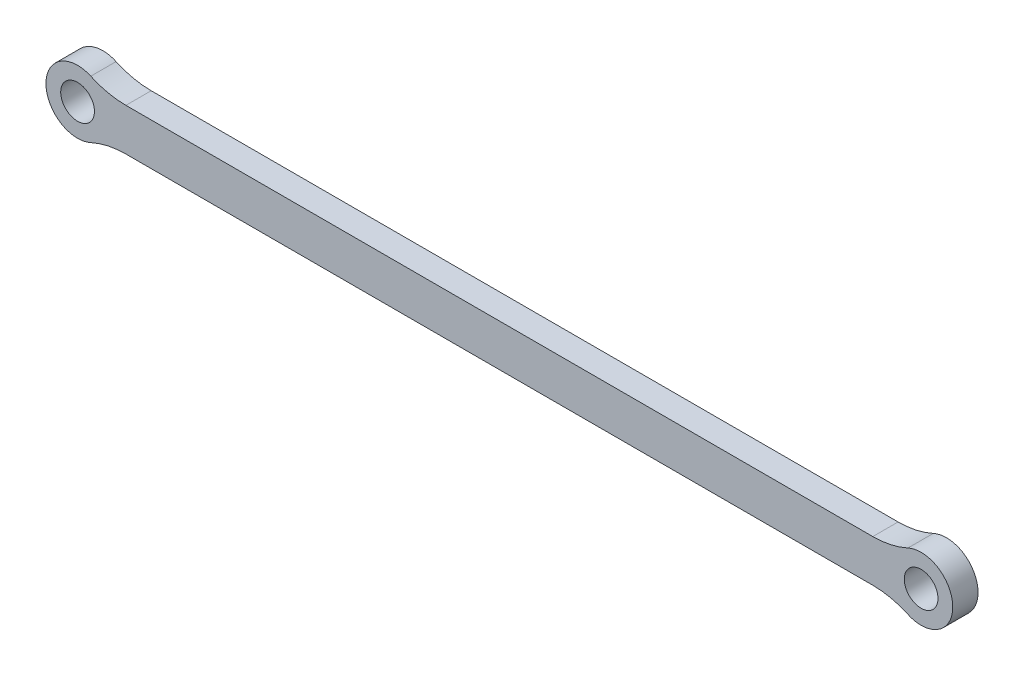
ISO-10303-21;
HEADER;
FILE_DESCRIPTION(('STEP AP214'),'2;1');
FILE_NAME('part.step','',(''),(''),'','','');
FILE_SCHEMA(('AUTOMOTIVE_DESIGN { 1 0 10303 214 1 1 1 1 }'));
ENDSEC;
DATA;
#1=APPLICATION_CONTEXT('core data for automotive mechanical design processes');
#2=APPLICATION_PROTOCOL_DEFINITION('international standard','automotive_design',2000,#1);
#3=PRODUCT_CONTEXT('',#1,'mechanical');
#4=PRODUCT('Part','Part','',(#3));
#5=PRODUCT_RELATED_PRODUCT_CATEGORY('part','',(#4));
#6=PRODUCT_DEFINITION_FORMATION('','',#4);
#7=PRODUCT_DEFINITION_CONTEXT('part definition',#1,'design');
#8=PRODUCT_DEFINITION('design','',#6,#7);
#9=PRODUCT_DEFINITION_SHAPE('','',#8);
#10=(LENGTH_UNIT() NAMED_UNIT(*) SI_UNIT(.MILLI.,.METRE.));
#11=(NAMED_UNIT(*) PLANE_ANGLE_UNIT() SI_UNIT($,.RADIAN.));
#12=(NAMED_UNIT(*) SI_UNIT($,.STERADIAN.) SOLID_ANGLE_UNIT());
#13=UNCERTAINTY_MEASURE_WITH_UNIT(LENGTH_MEASURE(1.E-05),#10,'distance_accuracy_value','');
#14=(GEOMETRIC_REPRESENTATION_CONTEXT(3) GLOBAL_UNCERTAINTY_ASSIGNED_CONTEXT((#13)) GLOBAL_UNIT_ASSIGNED_CONTEXT((#10,
#11,#12)) REPRESENTATION_CONTEXT('',''));
#15=CARTESIAN_POINT('',(0.,0.,0.));
#16=DIRECTION('',(0.,0.,1.));
#17=DIRECTION('',(1.,0.,0.));
#18=AXIS2_PLACEMENT_3D('',#15,#16,#17);
#19=CARTESIAN_POINT('',(-88.5435607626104,25.,3.));
#20=DIRECTION('',(0.,0.,1.));
#21=DIRECTION('',(1.,0.,0.));
#22=AXIS2_PLACEMENT_3D('',#19,#20,#21);
#23=PLANE('',#22);
#24=CARTESIAN_POINT('',(-100.,0.,3.));
#25=DIRECTION('',(0.,0.,1.));
#26=DIRECTION('',(1.,0.,0.));
#27=AXIS2_PLACEMENT_3D('',#24,#25,#26);
#28=CIRCLE('',#27,4.00000000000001);
#29=CARTESIAN_POINT('',(-96.,0.,3.));
#30=VERTEX_POINT('',#29);
#31=EDGE_CURVE('E138',#30,#30,#28,.T.);
#32=ORIENTED_EDGE('',*,*,#31,.F.);
#33=EDGE_LOOP('',(#32));
#34=FACE_BOUND('',#33,.T.);
#35=CARTESIAN_POINT('',(-88.5435607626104,25.,3.));
#36=DIRECTION('',(0.,0.,-1.));
#37=DIRECTION('',(1.,0.,0.));
#38=AXIS2_PLACEMENT_3D('',#35,#36,#37);
#39=CIRCLE('',#38,20.);
#40=CARTESIAN_POINT('',(-88.5435607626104,4.99999999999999,3.));
#41=VERTEX_POINT('',#40);
#42=CARTESIAN_POINT('',(-96.875516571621,6.81818181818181,3.));
#43=VERTEX_POINT('',#42);
#44=EDGE_CURVE('E149',#41,#43,#39,.T.);
#45=ORIENTED_EDGE('',*,*,#44,.T.);
#46=CARTESIAN_POINT('',(-100.,0.,3.));
#47=DIRECTION('',(0.,0.,1.));
#48=DIRECTION('',(1.,0.,0.));
#49=AXIS2_PLACEMENT_3D('',#46,#47,#48);
#50=CIRCLE('',#49,7.5);
#51=CARTESIAN_POINT('',(-96.875516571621,-6.81818181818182,3.));
#52=VERTEX_POINT('',#51);
#53=EDGE_CURVE('E97',#43,#52,#50,.T.);
#54=ORIENTED_EDGE('',*,*,#53,.T.);
#55=CARTESIAN_POINT('',(-88.5435607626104,-25.,3.));
#56=DIRECTION('',(0.,0.,-1.));
#57=DIRECTION('',(-1.,0.,0.));
#58=AXIS2_PLACEMENT_3D('',#55,#56,#57);
#59=CIRCLE('',#58,20.);
#60=CARTESIAN_POINT('',(-88.5435607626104,-5.,3.));
#61=VERTEX_POINT('',#60);
#62=EDGE_CURVE('E164',#52,#61,#59,.T.);
#63=ORIENTED_EDGE('',*,*,#62,.T.);
#64=DIRECTION('',(1.,0.,0.));
#65=VECTOR('',#64,1.);
#66=CARTESIAN_POINT('',(-88.5435607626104,-4.99999999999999,3.));
#67=LINE('',#66,#65);
#68=CARTESIAN_POINT('',(88.5435607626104,-4.99999999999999,3.));
#69=VERTEX_POINT('',#68);
#70=EDGE_CURVE('E177',#61,#69,#67,.T.);
#71=ORIENTED_EDGE('',*,*,#70,.T.);
#72=CARTESIAN_POINT('',(88.5435607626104,-25.,3.));
#73=DIRECTION('',(0.,0.,-1.));
#74=DIRECTION('',(1.,0.,0.));
#75=AXIS2_PLACEMENT_3D('',#72,#73,#74);
#76=CIRCLE('',#75,20.);
#77=CARTESIAN_POINT('',(96.875516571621,-6.81818181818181,3.));
#78=VERTEX_POINT('',#77);
#79=EDGE_CURVE('E116',#69,#78,#76,.T.);
#80=ORIENTED_EDGE('',*,*,#79,.T.);
#81=CARTESIAN_POINT('',(100.,0.,3.));
#82=DIRECTION('',(0.,0.,1.));
#83=DIRECTION('',(1.,0.,0.));
#84=AXIS2_PLACEMENT_3D('',#81,#82,#83);
#85=CIRCLE('',#84,7.5);
#86=CARTESIAN_POINT('',(96.875516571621,6.81818181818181,3.));
#87=VERTEX_POINT('',#86);
#88=EDGE_CURVE('E110',#78,#87,#85,.T.);
#89=ORIENTED_EDGE('',*,*,#88,.T.);
#90=CARTESIAN_POINT('',(88.5435607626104,25.,3.));
#91=DIRECTION('',(0.,0.,-1.));
#92=DIRECTION('',(-1.,0.,0.));
#93=AXIS2_PLACEMENT_3D('',#90,#91,#92);
#94=CIRCLE('',#93,20.);
#95=CARTESIAN_POINT('',(88.5435607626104,5.,3.));
#96=VERTEX_POINT('',#95);
#97=EDGE_CURVE('E114',#87,#96,#94,.T.);
#98=ORIENTED_EDGE('',*,*,#97,.T.);
#99=DIRECTION('',(-1.,0.,0.));
#100=VECTOR('',#99,1.);
#101=CARTESIAN_POINT('',(-88.5435607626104,4.99999999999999,3.));
#102=LINE('',#101,#100);
#103=EDGE_CURVE('E54',#96,#41,#102,.T.);
#104=ORIENTED_EDGE('',*,*,#103,.T.);
#105=EDGE_LOOP('',(#45,#54,#63,#71,#80,#89,#98,#104));
#106=FACE_BOUND('',#105,.T.);
#107=CARTESIAN_POINT('',(100.,0.,3.));
#108=DIRECTION('',(0.,0.,1.));
#109=DIRECTION('',(1.,0.,0.));
#110=AXIS2_PLACEMENT_3D('',#107,#108,#109);
#111=CIRCLE('',#110,4.00000000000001);
#112=CARTESIAN_POINT('',(104.,0.,3.));
#113=VERTEX_POINT('',#112);
#114=EDGE_CURVE('E186',#113,#113,#111,.T.);
#115=ORIENTED_EDGE('',*,*,#114,.F.);
#116=EDGE_LOOP('',(#115));
#117=FACE_BOUND('',#116,.T.);
#118=ADVANCED_FACE('F37',(#34,#106,#117),#23,.T.);
#119=CARTESIAN_POINT('',(-88.5435607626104,25.,-3.));
#120=DIRECTION('',(0.,0.,1.));
#121=DIRECTION('',(1.,0.,0.));
#122=AXIS2_PLACEMENT_3D('',#119,#120,#121);
#123=PLANE('',#122);
#124=CARTESIAN_POINT('',(-88.5435607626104,25.,-3.));
#125=DIRECTION('',(0.,0.,-1.));
#126=DIRECTION('',(1.,0.,0.));
#127=AXIS2_PLACEMENT_3D('',#124,#125,#126);
#128=CIRCLE('',#127,20.);
#129=CARTESIAN_POINT('',(-88.5435607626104,4.99999999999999,-3.));
#130=VERTEX_POINT('',#129);
#131=CARTESIAN_POINT('',(-96.875516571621,6.81818181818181,-3.));
#132=VERTEX_POINT('',#131);
#133=EDGE_CURVE('E134',#130,#132,#128,.T.);
#134=ORIENTED_EDGE('',*,*,#133,.F.);
#135=DIRECTION('',(-1.,0.,0.));
#136=VECTOR('',#135,1.);
#137=CARTESIAN_POINT('',(-88.5435607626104,4.99999999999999,-3.));
#138=LINE('',#137,#136);
#139=CARTESIAN_POINT('',(88.5435607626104,5.,-3.));
#140=VERTEX_POINT('',#139);
#141=EDGE_CURVE('E89',#140,#130,#138,.T.);
#142=ORIENTED_EDGE('',*,*,#141,.F.);
#143=CARTESIAN_POINT('',(88.5435607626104,25.,-3.));
#144=DIRECTION('',(0.,0.,-1.));
#145=DIRECTION('',(-1.,0.,0.));
#146=AXIS2_PLACEMENT_3D('',#143,#144,#145);
#147=CIRCLE('',#146,20.);
#148=CARTESIAN_POINT('',(96.875516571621,6.81818181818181,-3.));
#149=VERTEX_POINT('',#148);
#150=EDGE_CURVE('E83',#149,#140,#147,.T.);
#151=ORIENTED_EDGE('',*,*,#150,.F.);
#152=CARTESIAN_POINT('',(100.,0.,-3.));
#153=DIRECTION('',(0.,0.,1.));
#154=DIRECTION('',(1.,0.,0.));
#155=AXIS2_PLACEMENT_3D('',#152,#153,#154);
#156=CIRCLE('',#155,7.5);
#157=CARTESIAN_POINT('',(96.875516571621,-6.81818181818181,-3.));
#158=VERTEX_POINT('',#157);
#159=EDGE_CURVE('E124',#158,#149,#156,.T.);
#160=ORIENTED_EDGE('',*,*,#159,.F.);
#161=CARTESIAN_POINT('',(88.5435607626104,-25.,-3.));
#162=DIRECTION('',(0.,0.,-1.));
#163=DIRECTION('',(1.,0.,0.));
#164=AXIS2_PLACEMENT_3D('',#161,#162,#163);
#165=CIRCLE('',#164,20.);
#166=CARTESIAN_POINT('',(88.5435607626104,-4.99999999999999,-3.));
#167=VERTEX_POINT('',#166);
#168=EDGE_CURVE('E144',#167,#158,#165,.T.);
#169=ORIENTED_EDGE('',*,*,#168,.F.);
#170=DIRECTION('',(1.,0.,0.));
#171=VECTOR('',#170,1.);
#172=CARTESIAN_POINT('',(-88.5435607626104,-4.99999999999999,-3.));
#173=LINE('',#172,#171);
#174=CARTESIAN_POINT('',(-88.5435607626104,-5.,-3.));
#175=VERTEX_POINT('',#174);
#176=EDGE_CURVE('E142',#175,#167,#173,.T.);
#177=ORIENTED_EDGE('',*,*,#176,.F.);
#178=CARTESIAN_POINT('',(-88.5435607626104,-25.,-3.));
#179=DIRECTION('',(0.,0.,-1.));
#180=DIRECTION('',(-1.,0.,0.));
#181=AXIS2_PLACEMENT_3D('',#178,#179,#180);
#182=CIRCLE('',#181,20.);
#183=CARTESIAN_POINT('',(-96.875516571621,-6.81818181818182,-3.));
#184=VERTEX_POINT('',#183);
#185=EDGE_CURVE('E140',#184,#175,#182,.T.);
#186=ORIENTED_EDGE('',*,*,#185,.F.);
#187=CARTESIAN_POINT('',(-100.,0.,-3.));
#188=DIRECTION('',(0.,0.,1.));
#189=DIRECTION('',(1.,0.,0.));
#190=AXIS2_PLACEMENT_3D('',#187,#188,#189);
#191=CIRCLE('',#190,7.5);
#192=EDGE_CURVE('E137',#132,#184,#191,.T.);
#193=ORIENTED_EDGE('',*,*,#192,.F.);
#194=EDGE_LOOP('',(#134,#142,#151,#160,#169,#177,#186,#193));
#195=FACE_BOUND('',#194,.T.);
#196=CARTESIAN_POINT('',(-100.,0.,-3.));
#197=DIRECTION('',(0.,0.,1.));
#198=DIRECTION('',(1.,0.,0.));
#199=AXIS2_PLACEMENT_3D('',#196,#197,#198);
#200=CIRCLE('',#199,4.00000000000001);
#201=CARTESIAN_POINT('',(-96.,0.,-3.));
#202=VERTEX_POINT('',#201);
#203=EDGE_CURVE('E183',#202,#202,#200,.T.);
#204=ORIENTED_EDGE('',*,*,#203,.T.);
#205=EDGE_LOOP('',(#204));
#206=FACE_BOUND('',#205,.T.);
#207=CARTESIAN_POINT('',(100.,0.,-3.));
#208=DIRECTION('',(0.,0.,1.));
#209=DIRECTION('',(1.,0.,0.));
#210=AXIS2_PLACEMENT_3D('',#207,#208,#209);
#211=CIRCLE('',#210,4.00000000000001);
#212=CARTESIAN_POINT('',(104.,0.,-3.));
#213=VERTEX_POINT('',#212);
#214=EDGE_CURVE('E189',#213,#213,#211,.T.);
#215=ORIENTED_EDGE('',*,*,#214,.T.);
#216=EDGE_LOOP('',(#215));
#217=FACE_BOUND('',#216,.T.);
#218=ADVANCED_FACE('F168',(#195,#206,#217),#123,.F.);
#219=CARTESIAN_POINT('',(-88.5435607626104,25.,3.));
#220=DIRECTION('',(0.,0.,-1.));
#221=DIRECTION('',(-1.,0.,0.));
#222=AXIS2_PLACEMENT_3D('',#219,#220,#221);
#223=CYLINDRICAL_SURFACE('',#222,20.);
#224=ORIENTED_EDGE('',*,*,#133,.T.);
#225=DIRECTION('',(0.,0.,-1.));
#226=VECTOR('',#225,1.);
#227=CARTESIAN_POINT('',(-96.875516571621,6.81818181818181,3.));
#228=LINE('',#227,#226);
#229=EDGE_CURVE('E11',#43,#132,#228,.T.);
#230=ORIENTED_EDGE('',*,*,#229,.F.);
#231=ORIENTED_EDGE('',*,*,#44,.F.);
#232=DIRECTION('',(0.,0.,-1.));
#233=VECTOR('',#232,1.);
#234=CARTESIAN_POINT('',(-88.5435607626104,4.99999999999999,3.));
#235=LINE('',#234,#233);
#236=EDGE_CURVE('E130',#41,#130,#235,.T.);
#237=ORIENTED_EDGE('',*,*,#236,.T.);
#238=EDGE_LOOP('',(#224,#230,#231,#237));
#239=FACE_BOUND('',#238,.T.);
#240=ADVANCED_FACE('F39',(#239),#223,.F.);
#241=CARTESIAN_POINT('',(-100.,0.,3.));
#242=DIRECTION('',(0.,0.,-1.));
#243=DIRECTION('',(-1.,0.,0.));
#244=AXIS2_PLACEMENT_3D('',#241,#242,#243);
#245=CYLINDRICAL_SURFACE('',#244,7.5);
#246=ORIENTED_EDGE('',*,*,#192,.T.);
#247=DIRECTION('',(0.,0.,-1.));
#248=VECTOR('',#247,1.);
#249=CARTESIAN_POINT('',(-96.875516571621,-6.81818181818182,3.));
#250=LINE('',#249,#248);
#251=EDGE_CURVE('E46',#52,#184,#250,.T.);
#252=ORIENTED_EDGE('',*,*,#251,.F.);
#253=ORIENTED_EDGE('',*,*,#53,.F.);
#254=ORIENTED_EDGE('',*,*,#229,.T.);
#255=EDGE_LOOP('',(#246,#252,#253,#254));
#256=FACE_BOUND('',#255,.T.);
#257=ADVANCED_FACE('F221',(#256),#245,.T.);
#258=CARTESIAN_POINT('',(-88.5435607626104,-25.,3.));
#259=DIRECTION('',(0.,0.,-1.));
#260=DIRECTION('',(-1.,0.,0.));
#261=AXIS2_PLACEMENT_3D('',#258,#259,#260);
#262=CYLINDRICAL_SURFACE('',#261,20.);
#263=ORIENTED_EDGE('',*,*,#185,.T.);
#264=DIRECTION('',(0.,0.,-1.));
#265=VECTOR('',#264,1.);
#266=CARTESIAN_POINT('',(-88.5435607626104,-5.,3.));
#267=LINE('',#266,#265);
#268=EDGE_CURVE('E156',#61,#175,#267,.T.);
#269=ORIENTED_EDGE('',*,*,#268,.F.);
#270=ORIENTED_EDGE('',*,*,#62,.F.);
#271=ORIENTED_EDGE('',*,*,#251,.T.);
#272=EDGE_LOOP('',(#263,#269,#270,#271));
#273=FACE_BOUND('',#272,.T.);
#274=ADVANCED_FACE('F162',(#273),#262,.F.);
#275=CARTESIAN_POINT('',(-88.5435607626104,-4.99999999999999,3.));
#276=DIRECTION('',(0.,1.,0.));
#277=DIRECTION('',(0.,0.,1.));
#278=AXIS2_PLACEMENT_3D('',#275,#276,#277);
#279=PLANE('',#278);
#280=ORIENTED_EDGE('',*,*,#176,.T.);
#281=DIRECTION('',(0.,0.,-1.));
#282=VECTOR('',#281,1.);
#283=CARTESIAN_POINT('',(88.5435607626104,-4.99999999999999,3.));
#284=LINE('',#283,#282);
#285=EDGE_CURVE('E153',#69,#167,#284,.T.);
#286=ORIENTED_EDGE('',*,*,#285,.F.);
#287=ORIENTED_EDGE('',*,*,#70,.F.);
#288=ORIENTED_EDGE('',*,*,#268,.T.);
#289=EDGE_LOOP('',(#280,#286,#287,#288));
#290=FACE_BOUND('',#289,.T.);
#291=ADVANCED_FACE('F173',(#290),#279,.F.);
#292=CARTESIAN_POINT('',(88.5435607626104,-25.,3.));
#293=DIRECTION('',(0.,0.,-1.));
#294=DIRECTION('',(-1.,0.,0.));
#295=AXIS2_PLACEMENT_3D('',#292,#293,#294);
#296=CYLINDRICAL_SURFACE('',#295,20.);
#297=ORIENTED_EDGE('',*,*,#168,.T.);
#298=DIRECTION('',(0.,0.,-1.));
#299=VECTOR('',#298,1.);
#300=CARTESIAN_POINT('',(96.875516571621,-6.81818181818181,3.));
#301=LINE('',#300,#299);
#302=EDGE_CURVE('E125',#78,#158,#301,.T.);
#303=ORIENTED_EDGE('',*,*,#302,.F.);
#304=ORIENTED_EDGE('',*,*,#79,.F.);
#305=ORIENTED_EDGE('',*,*,#285,.T.);
#306=EDGE_LOOP('',(#297,#303,#304,#305));
#307=FACE_BOUND('',#306,.T.);
#308=ADVANCED_FACE('F176',(#307),#296,.F.);
#309=CARTESIAN_POINT('',(100.,0.,3.));
#310=DIRECTION('',(0.,0.,-1.));
#311=DIRECTION('',(-1.,0.,0.));
#312=AXIS2_PLACEMENT_3D('',#309,#310,#311);
#313=CYLINDRICAL_SURFACE('',#312,7.5);
#314=ORIENTED_EDGE('',*,*,#159,.T.);
#315=DIRECTION('',(0.,0.,-1.));
#316=VECTOR('',#315,1.);
#317=CARTESIAN_POINT('',(96.875516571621,6.81818181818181,3.));
#318=LINE('',#317,#316);
#319=EDGE_CURVE('E121',#87,#149,#318,.T.);
#320=ORIENTED_EDGE('',*,*,#319,.F.);
#321=ORIENTED_EDGE('',*,*,#88,.F.);
#322=ORIENTED_EDGE('',*,*,#302,.T.);
#323=EDGE_LOOP('',(#314,#320,#321,#322));
#324=FACE_BOUND('',#323,.T.);
#325=ADVANCED_FACE('F122',(#324),#313,.T.);
#326=CARTESIAN_POINT('',(88.5435607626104,25.,3.));
#327=DIRECTION('',(0.,0.,-1.));
#328=DIRECTION('',(-1.,0.,0.));
#329=AXIS2_PLACEMENT_3D('',#326,#327,#328);
#330=CYLINDRICAL_SURFACE('',#329,20.);
#331=ORIENTED_EDGE('',*,*,#150,.T.);
#332=DIRECTION('',(0.,0.,-1.));
#333=VECTOR('',#332,1.);
#334=CARTESIAN_POINT('',(88.5435607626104,5.,3.));
#335=LINE('',#334,#333);
#336=EDGE_CURVE('E126',#96,#140,#335,.T.);
#337=ORIENTED_EDGE('',*,*,#336,.F.);
#338=ORIENTED_EDGE('',*,*,#97,.F.);
#339=ORIENTED_EDGE('',*,*,#319,.T.);
#340=EDGE_LOOP('',(#331,#337,#338,#339));
#341=FACE_BOUND('',#340,.T.);
#342=ADVANCED_FACE('F128',(#341),#330,.F.);
#343=CARTESIAN_POINT('',(-88.5435607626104,4.99999999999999,3.));
#344=DIRECTION('',(0.,-1.,0.));
#345=DIRECTION('',(0.,0.,-1.));
#346=AXIS2_PLACEMENT_3D('',#343,#344,#345);
#347=PLANE('',#346);
#348=ORIENTED_EDGE('',*,*,#141,.T.);
#349=ORIENTED_EDGE('',*,*,#236,.F.);
#350=ORIENTED_EDGE('',*,*,#103,.F.);
#351=ORIENTED_EDGE('',*,*,#336,.T.);
#352=EDGE_LOOP('',(#348,#349,#350,#351));
#353=FACE_BOUND('',#352,.T.);
#354=ADVANCED_FACE('F209',(#353),#347,.F.);
#355=CARTESIAN_POINT('',(-100.,0.,3.));
#356=DIRECTION('',(0.,0.,-1.));
#357=DIRECTION('',(-1.,0.,0.));
#358=AXIS2_PLACEMENT_3D('',#355,#356,#357);
#359=CYLINDRICAL_SURFACE('',#358,4.00000000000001);
#360=ORIENTED_EDGE('',*,*,#31,.T.);
#361=EDGE_LOOP('',(#360));
#362=FACE_BOUND('',#361,.T.);
#363=ORIENTED_EDGE('',*,*,#203,.F.);
#364=EDGE_LOOP('',(#363));
#365=FACE_BOUND('',#364,.T.);
#366=ADVANCED_FACE('F206',(#362,#365),#359,.F.);
#367=CARTESIAN_POINT('',(100.,0.,3.));
#368=DIRECTION('',(0.,0.,-1.));
#369=DIRECTION('',(-1.,0.,0.));
#370=AXIS2_PLACEMENT_3D('',#367,#368,#369);
#371=CYLINDRICAL_SURFACE('',#370,4.00000000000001);
#372=ORIENTED_EDGE('',*,*,#114,.T.);
#373=EDGE_LOOP('',(#372));
#374=FACE_BOUND('',#373,.T.);
#375=ORIENTED_EDGE('',*,*,#214,.F.);
#376=EDGE_LOOP('',(#375));
#377=FACE_BOUND('',#376,.T.);
#378=ADVANCED_FACE('F195',(#374,#377),#371,.F.);
#379=CLOSED_SHELL('',(#118,#218,#240,#257,#274,#291,#308,#325,#342,#354,#366,#378));
#380=MANIFOLD_SOLID_BREP('B2',#379);
#381=ADVANCED_BREP_SHAPE_REPRESENTATION('',(#18,#380),#14);
#382=SHAPE_DEFINITION_REPRESENTATION(#9,#381);
ENDSEC;
END-ISO-10303-21;
